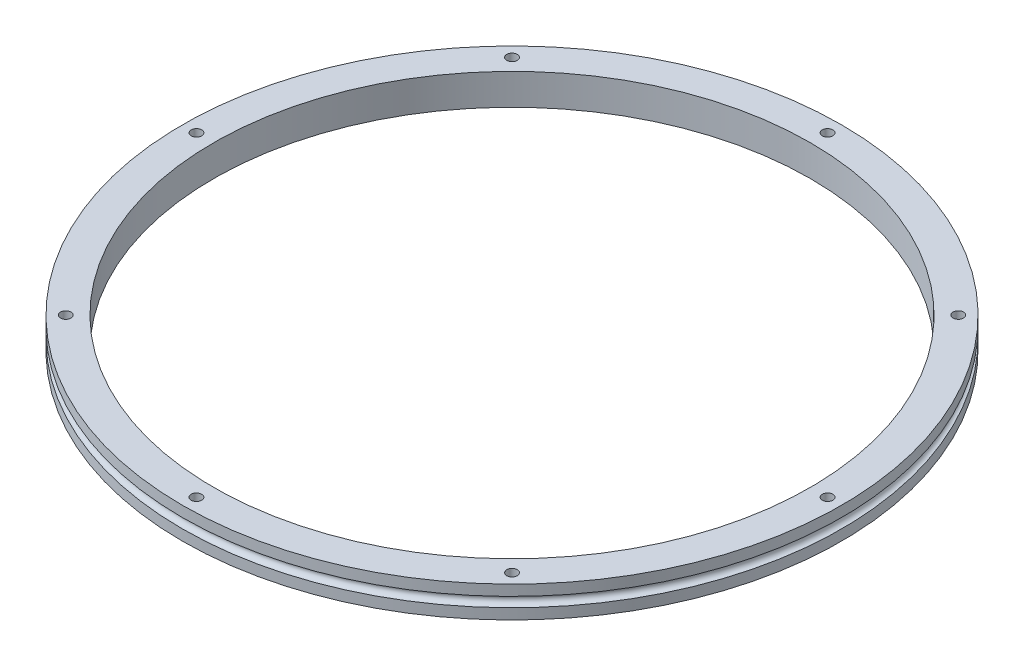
ISO-10303-21;
HEADER;
FILE_DESCRIPTION(('STEP AP214'),'2;1');
FILE_NAME('part.step','',(''),(''),'','','');
FILE_SCHEMA(('AUTOMOTIVE_DESIGN { 1 0 10303 214 1 1 1 1 }'));
ENDSEC;
DATA;
#1=APPLICATION_CONTEXT('core data for automotive mechanical design processes');
#2=APPLICATION_PROTOCOL_DEFINITION('international standard','automotive_design',2000,#1);
#3=PRODUCT_CONTEXT('',#1,'mechanical');
#4=PRODUCT('Part','Part','',(#3));
#5=PRODUCT_RELATED_PRODUCT_CATEGORY('part','',(#4));
#6=PRODUCT_DEFINITION_FORMATION('','',#4);
#7=PRODUCT_DEFINITION_CONTEXT('part definition',#1,'design');
#8=PRODUCT_DEFINITION('design','',#6,#7);
#9=PRODUCT_DEFINITION_SHAPE('','',#8);
#10=(LENGTH_UNIT() NAMED_UNIT(*) SI_UNIT(.MILLI.,.METRE.));
#11=(NAMED_UNIT(*) PLANE_ANGLE_UNIT() SI_UNIT($,.RADIAN.));
#12=(NAMED_UNIT(*) SI_UNIT($,.STERADIAN.) SOLID_ANGLE_UNIT());
#13=UNCERTAINTY_MEASURE_WITH_UNIT(LENGTH_MEASURE(1.E-05),#10,'distance_accuracy_value','');
#14=(GEOMETRIC_REPRESENTATION_CONTEXT(3) GLOBAL_UNCERTAINTY_ASSIGNED_CONTEXT((#13)) GLOBAL_UNIT_ASSIGNED_CONTEXT((#10,
#11,#12)) REPRESENTATION_CONTEXT('',''));
#15=CARTESIAN_POINT('',(0.,0.,0.));
#16=DIRECTION('',(0.,0.,1.));
#17=DIRECTION('',(1.,0.,0.));
#18=AXIS2_PLACEMENT_3D('',#15,#16,#17);
#19=CARTESIAN_POINT('',(0.,-6.35,-121.92));
#20=DIRECTION('',(0.,-1.,0.));
#21=DIRECTION('',(0.,0.,-1.));
#22=AXIS2_PLACEMENT_3D('',#19,#20,#21);
#23=PLANE('',#22);
#24=CARTESIAN_POINT('',(91.1495996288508,-6.35,-91.149599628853));
#25=DIRECTION('',(0.,1.,0.));
#26=DIRECTION('',(0.,0.,1.));
#27=AXIS2_PLACEMENT_3D('',#24,#25,#26);
#28=CIRCLE('',#27,2.15);
#29=CARTESIAN_POINT('',(91.1495996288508,-6.35,-88.999599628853));
#30=VERTEX_POINT('',#29);
#31=EDGE_CURVE('E135',#30,#30,#28,.T.);
#32=ORIENTED_EDGE('',*,*,#31,.T.);
#33=EDGE_LOOP('',(#32));
#34=FACE_BOUND('',#33,.T.);
#35=CARTESIAN_POINT('',(128.905,-6.35,-1.35020820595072E-12));
#36=DIRECTION('',(0.,1.,0.));
#37=DIRECTION('',(0.,0.,1.));
#38=AXIS2_PLACEMENT_3D('',#35,#36,#37);
#39=CIRCLE('',#38,2.14999999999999);
#40=CARTESIAN_POINT('',(128.905,-6.35,2.14999999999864));
#41=VERTEX_POINT('',#40);
#42=EDGE_CURVE('E127',#41,#41,#39,.T.);
#43=ORIENTED_EDGE('',*,*,#42,.T.);
#44=EDGE_LOOP('',(#43));
#45=FACE_BOUND('',#44,.T.);
#46=CARTESIAN_POINT('',(91.1495996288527,-6.35,91.1495996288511));
#47=DIRECTION('',(0.,1.,0.));
#48=DIRECTION('',(0.,0.,1.));
#49=AXIS2_PLACEMENT_3D('',#46,#47,#48);
#50=CIRCLE('',#49,2.15);
#51=CARTESIAN_POINT('',(91.1495996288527,-6.35,93.2995996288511));
#52=VERTEX_POINT('',#51);
#53=EDGE_CURVE('E119',#52,#52,#50,.T.);
#54=ORIENTED_EDGE('',*,*,#53,.T.);
#55=EDGE_LOOP('',(#54));
#56=FACE_BOUND('',#55,.T.);
#57=CARTESIAN_POINT('',(0.,-6.35,128.905));
#58=DIRECTION('',(0.,1.,0.));
#59=DIRECTION('',(0.,0.,1.));
#60=AXIS2_PLACEMENT_3D('',#57,#58,#59);
#61=CIRCLE('',#60,2.15);
#62=CARTESIAN_POINT('',(0.,-6.35,131.055));
#63=VERTEX_POINT('',#62);
#64=EDGE_CURVE('E111',#63,#63,#61,.T.);
#65=ORIENTED_EDGE('',*,*,#64,.T.);
#66=EDGE_LOOP('',(#65));
#67=FACE_BOUND('',#66,.T.);
#68=CARTESIAN_POINT('',(-91.1495996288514,-6.35,91.1495996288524));
#69=DIRECTION('',(0.,1.,0.));
#70=DIRECTION('',(0.,0.,1.));
#71=AXIS2_PLACEMENT_3D('',#68,#69,#70);
#72=CIRCLE('',#71,2.15);
#73=CARTESIAN_POINT('',(-91.1495996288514,-6.35,93.2995996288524));
#74=VERTEX_POINT('',#73);
#75=EDGE_CURVE('E103',#74,#74,#72,.T.);
#76=ORIENTED_EDGE('',*,*,#75,.T.);
#77=EDGE_LOOP('',(#76));
#78=FACE_BOUND('',#77,.T.);
#79=CARTESIAN_POINT('',(-128.905,-6.35,4.50069401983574E-13));
#80=DIRECTION('',(0.,1.,0.));
#81=DIRECTION('',(0.,0.,1.));
#82=AXIS2_PLACEMENT_3D('',#79,#80,#81);
#83=CIRCLE('',#82,2.14999999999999);
#84=CARTESIAN_POINT('',(-128.905,-6.35,2.15000000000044));
#85=VERTEX_POINT('',#84);
#86=EDGE_CURVE('E95',#85,#85,#83,.T.);
#87=ORIENTED_EDGE('',*,*,#86,.T.);
#88=EDGE_LOOP('',(#87));
#89=FACE_BOUND('',#88,.T.);
#90=CARTESIAN_POINT('',(0.,-6.35,0.));
#91=DIRECTION('',(0.,-1.,0.));
#92=DIRECTION('',(0.,0.,-1.));
#93=AXIS2_PLACEMENT_3D('',#90,#91,#92);
#94=CIRCLE('',#93,121.92);
#95=CARTESIAN_POINT('',(0.,-6.35,-121.92));
#96=VERTEX_POINT('',#95);
#97=EDGE_CURVE('E60',#96,#96,#94,.T.);
#98=ORIENTED_EDGE('',*,*,#97,.F.);
#99=EDGE_LOOP('',(#98));
#100=FACE_BOUND('',#99,.T.);
#101=CARTESIAN_POINT('',(0.,-6.35,0.));
#102=DIRECTION('',(0.,-1.,0.));
#103=DIRECTION('',(0.,0.,-1.));
#104=AXIS2_PLACEMENT_3D('',#101,#102,#103);
#105=CIRCLE('',#104,134.62);
#106=CARTESIAN_POINT('',(0.,-6.35,-134.62));
#107=VERTEX_POINT('',#106);
#108=EDGE_CURVE('E65',#107,#107,#105,.T.);
#109=ORIENTED_EDGE('',*,*,#108,.T.);
#110=EDGE_LOOP('',(#109));
#111=FACE_BOUND('',#110,.T.);
#112=CARTESIAN_POINT('',(0.,-6.35,-128.905));
#113=DIRECTION('',(0.,1.,0.));
#114=DIRECTION('',(0.,0.,1.));
#115=AXIS2_PLACEMENT_3D('',#112,#113,#114);
#116=CIRCLE('',#115,2.15);
#117=CARTESIAN_POINT('',(0.,-6.35,-126.755));
#118=VERTEX_POINT('',#117);
#119=EDGE_CURVE('E79',#118,#118,#116,.T.);
#120=ORIENTED_EDGE('',*,*,#119,.T.);
#121=EDGE_LOOP('',(#120));
#122=FACE_BOUND('',#121,.T.);
#123=CARTESIAN_POINT('',(-91.1495996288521,-6.35,-91.1495996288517));
#124=DIRECTION('',(0.,1.,0.));
#125=DIRECTION('',(0.,0.,1.));
#126=AXIS2_PLACEMENT_3D('',#123,#124,#125);
#127=CIRCLE('',#126,2.15);
#128=CARTESIAN_POINT('',(-91.1495996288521,-6.35,-88.9995996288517));
#129=VERTEX_POINT('',#128);
#130=EDGE_CURVE('E87',#129,#129,#127,.T.);
#131=ORIENTED_EDGE('',*,*,#130,.T.);
#132=EDGE_LOOP('',(#131));
#133=FACE_BOUND('',#132,.T.);
#134=ADVANCED_FACE('F47',(#34,#45,#56,#67,#78,#89,#100,#111,#122,#133),#23,.T.);
#135=CARTESIAN_POINT('',(0.,0.,0.));
#136=DIRECTION('',(0.,-1.,0.));
#137=DIRECTION('',(0.,0.,-1.));
#138=AXIS2_PLACEMENT_3D('',#135,#136,#137);
#139=CYLINDRICAL_SURFACE('',#138,134.62);
#140=CARTESIAN_POINT('',(0.,6.35,0.));
#141=DIRECTION('',(0.,-1.,0.));
#142=DIRECTION('',(0.,0.,-1.));
#143=AXIS2_PLACEMENT_3D('',#140,#141,#142);
#144=CIRCLE('',#143,134.62);
#145=CARTESIAN_POINT('',(0.,6.35,-134.62));
#146=VERTEX_POINT('',#145);
#147=EDGE_CURVE('E10',#146,#146,#144,.T.);
#148=ORIENTED_EDGE('',*,*,#147,.T.);
#149=EDGE_LOOP('',(#148));
#150=FACE_BOUND('',#149,.T.);
#151=CARTESIAN_POINT('',(0.,2.,0.));
#152=DIRECTION('',(0.,-1.,0.));
#153=DIRECTION('',(0.,0.,-1.));
#154=AXIS2_PLACEMENT_3D('',#151,#152,#153);
#155=CIRCLE('',#154,134.62);
#156=CARTESIAN_POINT('',(0.,2.,-134.62));
#157=VERTEX_POINT('',#156);
#158=EDGE_CURVE('E75',#157,#157,#155,.T.);
#159=ORIENTED_EDGE('',*,*,#158,.F.);
#160=EDGE_LOOP('',(#159));
#161=FACE_BOUND('',#160,.T.);
#162=ADVANCED_FACE('F49',(#150,#161),#139,.T.);
#163=CARTESIAN_POINT('',(0.,6.35,-134.62));
#164=DIRECTION('',(0.,1.,0.));
#165=DIRECTION('',(0.,0.,1.));
#166=AXIS2_PLACEMENT_3D('',#163,#164,#165);
#167=PLANE('',#166);
#168=CARTESIAN_POINT('',(91.1495996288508,6.35,-91.149599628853));
#169=DIRECTION('',(0.,1.,0.));
#170=DIRECTION('',(0.,0.,1.));
#171=AXIS2_PLACEMENT_3D('',#168,#169,#170);
#172=CIRCLE('',#171,2.15);
#173=CARTESIAN_POINT('',(91.1495996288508,6.35,-88.999599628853));
#174=VERTEX_POINT('',#173);
#175=EDGE_CURVE('E139',#174,#174,#172,.T.);
#176=ORIENTED_EDGE('',*,*,#175,.F.);
#177=EDGE_LOOP('',(#176));
#178=FACE_BOUND('',#177,.T.);
#179=CARTESIAN_POINT('',(128.905,6.35,-1.35020820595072E-12));
#180=DIRECTION('',(0.,1.,0.));
#181=DIRECTION('',(0.,0.,1.));
#182=AXIS2_PLACEMENT_3D('',#179,#180,#181);
#183=CIRCLE('',#182,2.14999999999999);
#184=CARTESIAN_POINT('',(128.905,6.35,2.14999999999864));
#185=VERTEX_POINT('',#184);
#186=EDGE_CURVE('E131',#185,#185,#183,.T.);
#187=ORIENTED_EDGE('',*,*,#186,.F.);
#188=EDGE_LOOP('',(#187));
#189=FACE_BOUND('',#188,.T.);
#190=CARTESIAN_POINT('',(91.1495996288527,6.35,91.1495996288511));
#191=DIRECTION('',(0.,1.,0.));
#192=DIRECTION('',(0.,0.,1.));
#193=AXIS2_PLACEMENT_3D('',#190,#191,#192);
#194=CIRCLE('',#193,2.15);
#195=CARTESIAN_POINT('',(91.1495996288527,6.35,93.2995996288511));
#196=VERTEX_POINT('',#195);
#197=EDGE_CURVE('E123',#196,#196,#194,.T.);
#198=ORIENTED_EDGE('',*,*,#197,.F.);
#199=EDGE_LOOP('',(#198));
#200=FACE_BOUND('',#199,.T.);
#201=CARTESIAN_POINT('',(0.,6.35,128.905));
#202=DIRECTION('',(0.,1.,0.));
#203=DIRECTION('',(0.,0.,1.));
#204=AXIS2_PLACEMENT_3D('',#201,#202,#203);
#205=CIRCLE('',#204,2.15);
#206=CARTESIAN_POINT('',(0.,6.35,131.055));
#207=VERTEX_POINT('',#206);
#208=EDGE_CURVE('E115',#207,#207,#205,.T.);
#209=ORIENTED_EDGE('',*,*,#208,.F.);
#210=EDGE_LOOP('',(#209));
#211=FACE_BOUND('',#210,.T.);
#212=CARTESIAN_POINT('',(-91.1495996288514,6.35,91.1495996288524));
#213=DIRECTION('',(0.,1.,0.));
#214=DIRECTION('',(0.,0.,1.));
#215=AXIS2_PLACEMENT_3D('',#212,#213,#214);
#216=CIRCLE('',#215,2.15);
#217=CARTESIAN_POINT('',(-91.1495996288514,6.35,93.2995996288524));
#218=VERTEX_POINT('',#217);
#219=EDGE_CURVE('E107',#218,#218,#216,.T.);
#220=ORIENTED_EDGE('',*,*,#219,.F.);
#221=EDGE_LOOP('',(#220));
#222=FACE_BOUND('',#221,.T.);
#223=CARTESIAN_POINT('',(-128.905,6.35,4.50069401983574E-13));
#224=DIRECTION('',(0.,1.,0.));
#225=DIRECTION('',(0.,0.,1.));
#226=AXIS2_PLACEMENT_3D('',#223,#224,#225);
#227=CIRCLE('',#226,2.14999999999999);
#228=CARTESIAN_POINT('',(-128.905,6.35,2.15000000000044));
#229=VERTEX_POINT('',#228);
#230=EDGE_CURVE('E99',#229,#229,#227,.T.);
#231=ORIENTED_EDGE('',*,*,#230,.F.);
#232=EDGE_LOOP('',(#231));
#233=FACE_BOUND('',#232,.T.);
#234=CARTESIAN_POINT('',(-91.1495996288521,6.35,-91.1495996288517));
#235=DIRECTION('',(0.,1.,0.));
#236=DIRECTION('',(0.,0.,1.));
#237=AXIS2_PLACEMENT_3D('',#234,#235,#236);
#238=CIRCLE('',#237,2.15);
#239=CARTESIAN_POINT('',(-91.1495996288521,6.35,-88.9995996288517));
#240=VERTEX_POINT('',#239);
#241=EDGE_CURVE('E91',#240,#240,#238,.T.);
#242=ORIENTED_EDGE('',*,*,#241,.F.);
#243=EDGE_LOOP('',(#242));
#244=FACE_BOUND('',#243,.T.);
#245=CARTESIAN_POINT('',(0.,6.35,-128.905));
#246=DIRECTION('',(0.,1.,0.));
#247=DIRECTION('',(0.,0.,1.));
#248=AXIS2_PLACEMENT_3D('',#245,#246,#247);
#249=CIRCLE('',#248,2.15);
#250=CARTESIAN_POINT('',(0.,6.35,-126.755));
#251=VERTEX_POINT('',#250);
#252=EDGE_CURVE('E83',#251,#251,#249,.T.);
#253=ORIENTED_EDGE('',*,*,#252,.F.);
#254=EDGE_LOOP('',(#253));
#255=FACE_BOUND('',#254,.T.);
#256=CARTESIAN_POINT('',(0.,6.35,0.));
#257=DIRECTION('',(0.,-1.,0.));
#258=DIRECTION('',(0.,0.,-1.));
#259=AXIS2_PLACEMENT_3D('',#256,#257,#258);
#260=CIRCLE('',#259,121.92);
#261=CARTESIAN_POINT('',(0.,6.35,-121.92));
#262=VERTEX_POINT('',#261);
#263=EDGE_CURVE('E55',#262,#262,#260,.T.);
#264=ORIENTED_EDGE('',*,*,#263,.T.);
#265=EDGE_LOOP('',(#264));
#266=FACE_BOUND('',#265,.T.);
#267=ORIENTED_EDGE('',*,*,#147,.F.);
#268=EDGE_LOOP('',(#267));
#269=FACE_BOUND('',#268,.T.);
#270=ADVANCED_FACE('F146',(#178,#189,#200,#211,#222,#233,#244,#255,#266,#269),#167,.T.);
#271=CARTESIAN_POINT('',(0.,0.,0.));
#272=DIRECTION('',(0.,-1.,0.));
#273=DIRECTION('',(0.,0.,-1.));
#274=AXIS2_PLACEMENT_3D('',#271,#272,#273);
#275=CYLINDRICAL_SURFACE('',#274,121.92);
#276=ORIENTED_EDGE('',*,*,#97,.T.);
#277=EDGE_LOOP('',(#276));
#278=FACE_BOUND('',#277,.T.);
#279=ORIENTED_EDGE('',*,*,#263,.F.);
#280=EDGE_LOOP('',(#279));
#281=FACE_BOUND('',#280,.T.);
#282=ADVANCED_FACE('F149',(#278,#281),#275,.F.);
#283=CARTESIAN_POINT('',(0.,0.,0.));
#284=DIRECTION('',(0.,-1.,0.));
#285=DIRECTION('',(0.,0.,-1.));
#286=AXIS2_PLACEMENT_3D('',#283,#284,#285);
#287=CYLINDRICAL_SURFACE('',#286,134.62);
#288=CARTESIAN_POINT('',(0.,-2.,0.));
#289=DIRECTION('',(0.,-1.,0.));
#290=DIRECTION('',(0.,0.,-1.));
#291=AXIS2_PLACEMENT_3D('',#288,#289,#290);
#292=CIRCLE('',#291,134.62);
#293=CARTESIAN_POINT('',(0.,-2.,-134.62));
#294=VERTEX_POINT('',#293);
#295=EDGE_CURVE('E71',#294,#294,#292,.T.);
#296=ORIENTED_EDGE('',*,*,#295,.T.);
#297=EDGE_LOOP('',(#296));
#298=FACE_BOUND('',#297,.T.);
#299=ORIENTED_EDGE('',*,*,#108,.F.);
#300=EDGE_LOOP('',(#299));
#301=FACE_BOUND('',#300,.T.);
#302=ADVANCED_FACE('F179',(#298,#301),#287,.T.);
#303=CARTESIAN_POINT('',(0.,0.,0.));
#304=DIRECTION('',(0.,-1.,0.));
#305=DIRECTION('',(0.,0.,-1.));
#306=AXIS2_PLACEMENT_3D('',#303,#304,#305);
#307=TOROIDAL_SURFACE('',#306,134.62,2.);
#308=ORIENTED_EDGE('',*,*,#158,.T.);
#309=EDGE_LOOP('',(#308));
#310=FACE_BOUND('',#309,.T.);
#311=ORIENTED_EDGE('',*,*,#295,.F.);
#312=EDGE_LOOP('',(#311));
#313=FACE_BOUND('',#312,.T.);
#314=ADVANCED_FACE('F168',(#310,#313),#307,.F.);
#315=CARTESIAN_POINT('',(0.,6.35,-128.905));
#316=DIRECTION('',(0.,1.,0.));
#317=DIRECTION('',(0.,0.,1.));
#318=AXIS2_PLACEMENT_3D('',#315,#316,#317);
#319=CYLINDRICAL_SURFACE('',#318,2.15);
#320=ORIENTED_EDGE('',*,*,#119,.F.);
#321=EDGE_LOOP('',(#320));
#322=FACE_BOUND('',#321,.T.);
#323=ORIENTED_EDGE('',*,*,#252,.T.);
#324=EDGE_LOOP('',(#323));
#325=FACE_BOUND('',#324,.T.);
#326=ADVANCED_FACE('F165',(#322,#325),#319,.F.);
#327=CARTESIAN_POINT('',(-91.1495996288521,6.35,-91.1495996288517));
#328=DIRECTION('',(0.,1.,0.));
#329=DIRECTION('',(0.,0.,1.));
#330=AXIS2_PLACEMENT_3D('',#327,#328,#329);
#331=CYLINDRICAL_SURFACE('',#330,2.15);
#332=ORIENTED_EDGE('',*,*,#130,.F.);
#333=EDGE_LOOP('',(#332));
#334=FACE_BOUND('',#333,.T.);
#335=ORIENTED_EDGE('',*,*,#241,.T.);
#336=EDGE_LOOP('',(#335));
#337=FACE_BOUND('',#336,.T.);
#338=ADVANCED_FACE('F167',(#334,#337),#331,.F.);
#339=CARTESIAN_POINT('',(-128.905,6.35,4.50069401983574E-13));
#340=DIRECTION('',(0.,1.,0.));
#341=DIRECTION('',(0.,0.,1.));
#342=AXIS2_PLACEMENT_3D('',#339,#340,#341);
#343=CYLINDRICAL_SURFACE('',#342,2.14999999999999);
#344=ORIENTED_EDGE('',*,*,#86,.F.);
#345=EDGE_LOOP('',(#344));
#346=FACE_BOUND('',#345,.T.);
#347=ORIENTED_EDGE('',*,*,#230,.T.);
#348=EDGE_LOOP('',(#347));
#349=FACE_BOUND('',#348,.T.);
#350=ADVANCED_FACE('F176',(#346,#349),#343,.F.);
#351=CARTESIAN_POINT('',(-91.1495996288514,6.35,91.1495996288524));
#352=DIRECTION('',(0.,1.,0.));
#353=DIRECTION('',(0.,0.,1.));
#354=AXIS2_PLACEMENT_3D('',#351,#352,#353);
#355=CYLINDRICAL_SURFACE('',#354,2.15);
#356=ORIENTED_EDGE('',*,*,#75,.F.);
#357=EDGE_LOOP('',(#356));
#358=FACE_BOUND('',#357,.T.);
#359=ORIENTED_EDGE('',*,*,#219,.T.);
#360=EDGE_LOOP('',(#359));
#361=FACE_BOUND('',#360,.T.);
#362=ADVANCED_FACE('F240',(#358,#361),#355,.F.);
#363=CARTESIAN_POINT('',(0.,6.35,128.905));
#364=DIRECTION('',(0.,1.,0.));
#365=DIRECTION('',(0.,0.,1.));
#366=AXIS2_PLACEMENT_3D('',#363,#364,#365);
#367=CYLINDRICAL_SURFACE('',#366,2.15);
#368=ORIENTED_EDGE('',*,*,#64,.F.);
#369=EDGE_LOOP('',(#368));
#370=FACE_BOUND('',#369,.T.);
#371=ORIENTED_EDGE('',*,*,#208,.T.);
#372=EDGE_LOOP('',(#371));
#373=FACE_BOUND('',#372,.T.);
#374=ADVANCED_FACE('F250',(#370,#373),#367,.F.);
#375=CARTESIAN_POINT('',(91.1495996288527,6.35,91.1495996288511));
#376=DIRECTION('',(0.,1.,0.));
#377=DIRECTION('',(0.,0.,1.));
#378=AXIS2_PLACEMENT_3D('',#375,#376,#377);
#379=CYLINDRICAL_SURFACE('',#378,2.15);
#380=ORIENTED_EDGE('',*,*,#53,.F.);
#381=EDGE_LOOP('',(#380));
#382=FACE_BOUND('',#381,.T.);
#383=ORIENTED_EDGE('',*,*,#197,.T.);
#384=EDGE_LOOP('',(#383));
#385=FACE_BOUND('',#384,.T.);
#386=ADVANCED_FACE('F260',(#382,#385),#379,.F.);
#387=CARTESIAN_POINT('',(128.905,6.35,-1.35020820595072E-12));
#388=DIRECTION('',(0.,1.,0.));
#389=DIRECTION('',(0.,0.,1.));
#390=AXIS2_PLACEMENT_3D('',#387,#388,#389);
#391=CYLINDRICAL_SURFACE('',#390,2.14999999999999);
#392=ORIENTED_EDGE('',*,*,#42,.F.);
#393=EDGE_LOOP('',(#392));
#394=FACE_BOUND('',#393,.T.);
#395=ORIENTED_EDGE('',*,*,#186,.T.);
#396=EDGE_LOOP('',(#395));
#397=FACE_BOUND('',#396,.T.);
#398=ADVANCED_FACE('F270',(#394,#397),#391,.F.);
#399=CARTESIAN_POINT('',(91.1495996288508,6.35,-91.149599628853));
#400=DIRECTION('',(0.,1.,0.));
#401=DIRECTION('',(0.,0.,1.));
#402=AXIS2_PLACEMENT_3D('',#399,#400,#401);
#403=CYLINDRICAL_SURFACE('',#402,2.15);
#404=ORIENTED_EDGE('',*,*,#31,.F.);
#405=EDGE_LOOP('',(#404));
#406=FACE_BOUND('',#405,.T.);
#407=ORIENTED_EDGE('',*,*,#175,.T.);
#408=EDGE_LOOP('',(#407));
#409=FACE_BOUND('',#408,.T.);
#410=ADVANCED_FACE('F144',(#406,#409),#403,.F.);
#411=CLOSED_SHELL('',(#134,#162,#270,#282,#302,#314,#326,#338,#350,#362,#374,#386,#398,#410));
#412=MANIFOLD_SOLID_BREP('B2',#411);
#413=ADVANCED_BREP_SHAPE_REPRESENTATION('',(#18,#412),#14);
#414=SHAPE_DEFINITION_REPRESENTATION(#9,#413);
ENDSEC;
END-ISO-10303-21;
